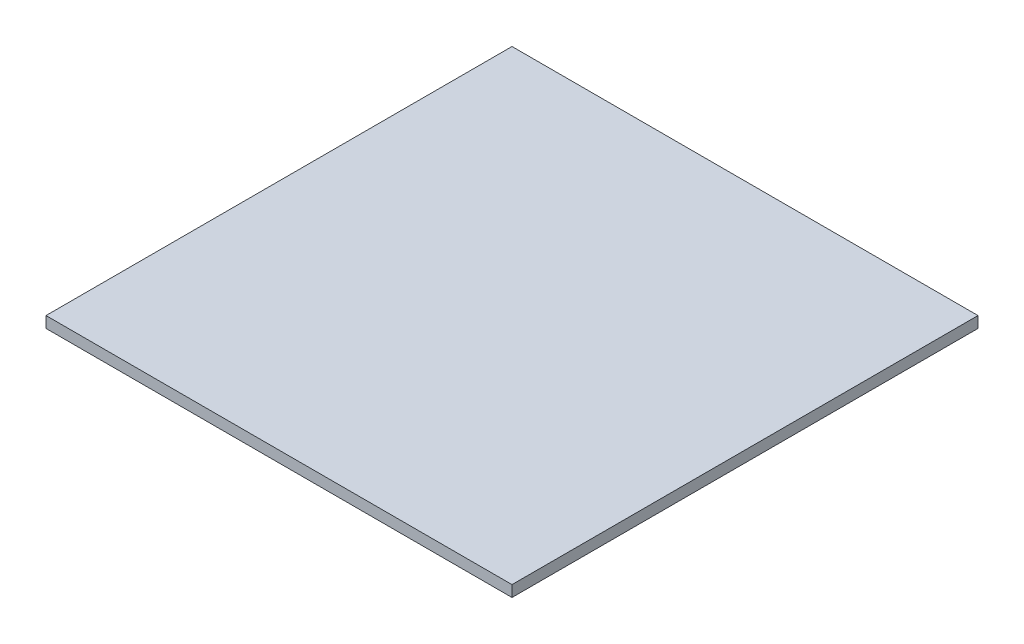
ISO-10303-21;
HEADER;
FILE_DESCRIPTION(('STEP AP214'),'2;1');
FILE_NAME('part.step','',(''),(''),'','','');
FILE_SCHEMA(('AUTOMOTIVE_DESIGN { 1 0 10303 214 1 1 1 1 }'));
ENDSEC;
DATA;
#1=APPLICATION_CONTEXT('core data for automotive mechanical design processes');
#2=APPLICATION_PROTOCOL_DEFINITION('international standard','automotive_design',2000,#1);
#3=PRODUCT_CONTEXT('',#1,'mechanical');
#4=PRODUCT('Part','Part','',(#3));
#5=PRODUCT_RELATED_PRODUCT_CATEGORY('part','',(#4));
#6=PRODUCT_DEFINITION_FORMATION('','',#4);
#7=PRODUCT_DEFINITION_CONTEXT('part definition',#1,'design');
#8=PRODUCT_DEFINITION('design','',#6,#7);
#9=PRODUCT_DEFINITION_SHAPE('','',#8);
#10=(LENGTH_UNIT() NAMED_UNIT(*) SI_UNIT(.MILLI.,.METRE.));
#11=(NAMED_UNIT(*) PLANE_ANGLE_UNIT() SI_UNIT($,.RADIAN.));
#12=(NAMED_UNIT(*) SI_UNIT($,.STERADIAN.) SOLID_ANGLE_UNIT());
#13=UNCERTAINTY_MEASURE_WITH_UNIT(LENGTH_MEASURE(1.E-05),#10,'distance_accuracy_value','');
#14=(GEOMETRIC_REPRESENTATION_CONTEXT(3) GLOBAL_UNCERTAINTY_ASSIGNED_CONTEXT((#13)) GLOBAL_UNIT_ASSIGNED_CONTEXT((#10,
#11,#12)) REPRESENTATION_CONTEXT('',''));
#15=CARTESIAN_POINT('',(0.,0.,0.));
#16=DIRECTION('',(0.,0.,1.));
#17=DIRECTION('',(1.,0.,0.));
#18=AXIS2_PLACEMENT_3D('',#15,#16,#17);
#19=CARTESIAN_POINT('',(0.,6.,0.));
#20=DIRECTION('',(0.,0.,-1.));
#21=DIRECTION('',(-1.,0.,0.));
#22=AXIS2_PLACEMENT_3D('',#19,#20,#21);
#23=PLANE('',#22);
#24=DIRECTION('',(1.,0.,0.));
#25=VECTOR('',#24,1.);
#26=CARTESIAN_POINT('',(0.,0.,0.));
#27=LINE('',#26,#25);
#28=CARTESIAN_POINT('',(-12.,0.,0.));
#29=VERTEX_POINT('',#28);
#30=CARTESIAN_POINT('',(238.,0.,0.));
#31=VERTEX_POINT('',#30);
#32=EDGE_CURVE('E73',#29,#31,#27,.T.);
#33=ORIENTED_EDGE('',*,*,#32,.T.);
#34=DIRECTION('',(0.,-1.,0.));
#35=VECTOR('',#34,1.);
#36=CARTESIAN_POINT('',(238.,6.,0.));
#37=LINE('',#36,#35);
#38=CARTESIAN_POINT('',(238.,6.,0.));
#39=VERTEX_POINT('',#38);
#40=EDGE_CURVE('E11',#39,#31,#37,.T.);
#41=ORIENTED_EDGE('',*,*,#40,.F.);
#42=DIRECTION('',(1.,0.,0.));
#43=VECTOR('',#42,1.);
#44=CARTESIAN_POINT('',(0.,6.,0.));
#45=LINE('',#44,#43);
#46=CARTESIAN_POINT('',(-12.,6.,0.));
#47=VERTEX_POINT('',#46);
#48=EDGE_CURVE('E87',#47,#39,#45,.T.);
#49=ORIENTED_EDGE('',*,*,#48,.F.);
#50=DIRECTION('',(0.,1.,0.));
#51=VECTOR('',#50,1.);
#52=CARTESIAN_POINT('',(-12.,6.,0.));
#53=LINE('',#52,#51);
#54=EDGE_CURVE('E90',#29,#47,#53,.T.);
#55=ORIENTED_EDGE('',*,*,#54,.F.);
#56=EDGE_LOOP('',(#33,#41,#49,#55));
#57=FACE_BOUND('',#56,.T.);
#58=ADVANCED_FACE('F45',(#57),#23,.F.);
#59=CARTESIAN_POINT('',(238.,6.,0.));
#60=DIRECTION('',(-1.,0.,0.));
#61=DIRECTION('',(0.,0.,1.));
#62=AXIS2_PLACEMENT_3D('',#59,#60,#61);
#63=PLANE('',#62);
#64=DIRECTION('',(0.,0.,-1.));
#65=VECTOR('',#64,1.);
#66=CARTESIAN_POINT('',(238.,0.,0.));
#67=LINE('',#66,#65);
#68=CARTESIAN_POINT('',(238.,0.,-250.));
#69=VERTEX_POINT('',#68);
#70=EDGE_CURVE('E120',#31,#69,#67,.T.);
#71=ORIENTED_EDGE('',*,*,#70,.T.);
#72=DIRECTION('',(0.,-1.,0.));
#73=VECTOR('',#72,1.);
#74=CARTESIAN_POINT('',(238.,6.,-250.));
#75=LINE('',#74,#73);
#76=CARTESIAN_POINT('',(238.,6.,-250.));
#77=VERTEX_POINT('',#76);
#78=EDGE_CURVE('E54',#77,#69,#75,.T.);
#79=ORIENTED_EDGE('',*,*,#78,.F.);
#80=DIRECTION('',(0.,0.,-1.));
#81=VECTOR('',#80,1.);
#82=CARTESIAN_POINT('',(238.,6.,0.));
#83=LINE('',#82,#81);
#84=EDGE_CURVE('E62',#39,#77,#83,.T.);
#85=ORIENTED_EDGE('',*,*,#84,.F.);
#86=ORIENTED_EDGE('',*,*,#40,.T.);
#87=EDGE_LOOP('',(#71,#79,#85,#86));
#88=FACE_BOUND('',#87,.T.);
#89=ADVANCED_FACE('F131',(#88),#63,.F.);
#90=CARTESIAN_POINT('',(0.,6.,-250.));
#91=DIRECTION('',(0.,0.,1.));
#92=DIRECTION('',(1.,0.,0.));
#93=AXIS2_PLACEMENT_3D('',#90,#91,#92);
#94=PLANE('',#93);
#95=DIRECTION('',(-1.,0.,0.));
#96=VECTOR('',#95,1.);
#97=CARTESIAN_POINT('',(0.,0.,-250.));
#98=LINE('',#97,#96);
#99=CARTESIAN_POINT('',(-12.,0.,-250.));
#100=VERTEX_POINT('',#99);
#101=EDGE_CURVE('E92',#69,#100,#98,.T.);
#102=ORIENTED_EDGE('',*,*,#101,.T.);
#103=DIRECTION('',(0.,-1.,0.));
#104=VECTOR('',#103,1.);
#105=CARTESIAN_POINT('',(-12.,6.,-250.));
#106=LINE('',#105,#104);
#107=CARTESIAN_POINT('',(-12.,6.,-250.));
#108=VERTEX_POINT('',#107);
#109=EDGE_CURVE('E103',#108,#100,#106,.T.);
#110=ORIENTED_EDGE('',*,*,#109,.F.);
#111=DIRECTION('',(-1.,0.,0.));
#112=VECTOR('',#111,1.);
#113=CARTESIAN_POINT('',(0.,6.,-250.));
#114=LINE('',#113,#112);
#115=EDGE_CURVE('E98',#77,#108,#114,.T.);
#116=ORIENTED_EDGE('',*,*,#115,.F.);
#117=ORIENTED_EDGE('',*,*,#78,.T.);
#118=EDGE_LOOP('',(#102,#110,#116,#117));
#119=FACE_BOUND('',#118,.T.);
#120=ADVANCED_FACE('F128',(#119),#94,.F.);
#121=CARTESIAN_POINT('',(0.,6.,0.));
#122=DIRECTION('',(0.,-1.,0.));
#123=DIRECTION('',(0.,0.,-1.));
#124=AXIS2_PLACEMENT_3D('',#121,#122,#123);
#125=PLANE('',#124);
#126=ORIENTED_EDGE('',*,*,#115,.T.);
#127=DIRECTION('',(0.,0.,-1.));
#128=VECTOR('',#127,1.);
#129=CARTESIAN_POINT('',(-12.,6.,0.));
#130=LINE('',#129,#128);
#131=EDGE_CURVE('E95',#47,#108,#130,.T.);
#132=ORIENTED_EDGE('',*,*,#131,.F.);
#133=ORIENTED_EDGE('',*,*,#48,.T.);
#134=ORIENTED_EDGE('',*,*,#84,.T.);
#135=EDGE_LOOP('',(#126,#132,#133,#134));
#136=FACE_BOUND('',#135,.T.);
#137=ADVANCED_FACE('F96',(#136),#125,.F.);
#138=CARTESIAN_POINT('',(0.,0.,0.));
#139=DIRECTION('',(0.,-1.,0.));
#140=DIRECTION('',(0.,0.,-1.));
#141=AXIS2_PLACEMENT_3D('',#138,#139,#140);
#142=PLANE('',#141);
#143=ORIENTED_EDGE('',*,*,#32,.F.);
#144=DIRECTION('',(0.,0.,1.));
#145=VECTOR('',#144,1.);
#146=CARTESIAN_POINT('',(-12.,0.,0.));
#147=LINE('',#146,#145);
#148=EDGE_CURVE('E106',#100,#29,#147,.T.);
#149=ORIENTED_EDGE('',*,*,#148,.F.);
#150=ORIENTED_EDGE('',*,*,#101,.F.);
#151=ORIENTED_EDGE('',*,*,#70,.F.);
#152=EDGE_LOOP('',(#143,#149,#150,#151));
#153=FACE_BOUND('',#152,.T.);
#154=ADVANCED_FACE('F130',(#153),#142,.T.);
#155=CARTESIAN_POINT('',(-12.,0.,0.));
#156=DIRECTION('',(1.,0.,0.));
#157=DIRECTION('',(0.,0.,-1.));
#158=AXIS2_PLACEMENT_3D('',#155,#156,#157);
#159=PLANE('',#158);
#160=ORIENTED_EDGE('',*,*,#54,.T.);
#161=ORIENTED_EDGE('',*,*,#131,.T.);
#162=ORIENTED_EDGE('',*,*,#109,.T.);
#163=ORIENTED_EDGE('',*,*,#148,.T.);
#164=EDGE_LOOP('',(#160,#161,#162,#163));
#165=FACE_BOUND('',#164,.T.);
#166=ADVANCED_FACE('F105',(#165),#159,.F.);
#167=CLOSED_SHELL('',(#58,#89,#120,#137,#154,#166));
#168=MANIFOLD_SOLID_BREP('B2',#167);
#169=ADVANCED_BREP_SHAPE_REPRESENTATION('',(#18,#168),#14);
#170=SHAPE_DEFINITION_REPRESENTATION(#9,#169);
ENDSEC;
END-ISO-10303-21;
